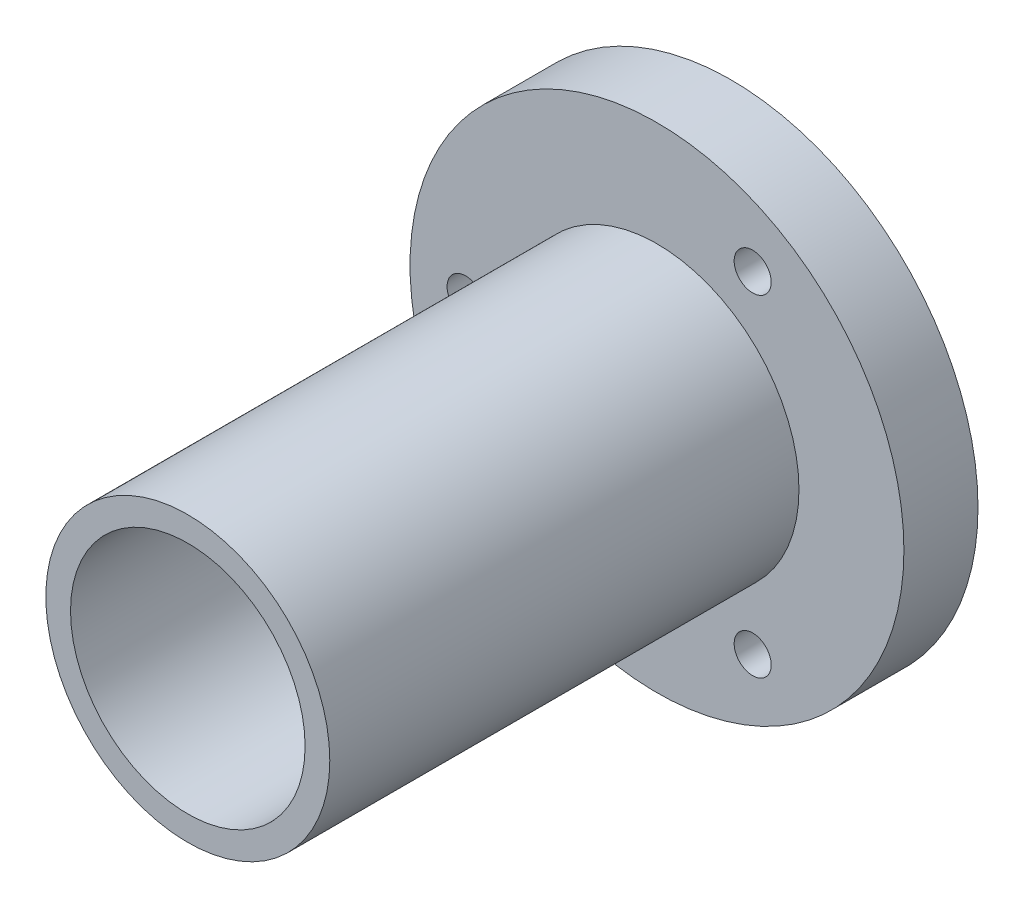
from build123d import *

# Parameters (mm, degrees)
ESQUISSE1_R                       = 20
BOSS_EXTRU_1_DEPTH                = 6
ESQUISSE2_R                       = 11.5
BOSS_EXTRU_2_DEPTH                = 38
DIAM_TRE_DU_PER_AGE_0_15_0_15_1_D = 19
DIAM_TRE_DU_PER_AGE_0_15_0_15_2_D = 3
R_P_TITION_CIRCULAIRE1_COUNT      = 3


with BuildPart() as part:
    # Esquisse1 → Boss.-Extru.1 (new body)
    with BuildSketch(Plane.XY):
        Circle(ESQUISSE1_R)
    extrude(amount=BOSS_EXTRU_1_DEPTH)

    # Esquisse2 → Boss.-Extru.2 (add)
    with BuildSketch(Plane.XY.offset(6)):
        Circle(ESQUISSE2_R)
    extrude(amount=BOSS_EXTRU_2_DEPTH)

    # Diam_tre du per_age _0.15 _0.15_1 (through all)
    with Locations(Plane(origin=(0, 0, 0), x_dir=(-1, 0, 0), z_dir=(0, 0, -1))):
        with Locations((0, 0)):
            Hole(DIAM_TRE_DU_PER_AGE_0_15_0_15_1_D / 2)

    # Diam_tre du per_age _0.15 _0.15_2 (through all)
    with Locations(Plane(origin=(0, 0, 0), x_dir=(-1, 0, 0), z_dir=(0, 0, -1))):
        with Locations((15.5, 0)):
            diam_tre_du_per_age_0_15_0_15_2 = Hole(DIAM_TRE_DU_PER_AGE_0_15_0_15_2_D / 2)

    # R_p_tition circulaire1: Diam_tre du per_age _0.15 _0.15_2 ×3 about axis
    r_p_tition_circulaire1_axis = Axis((0, 0, 0), (0, 0, 1))
    for i in range(1, R_P_TITION_CIRCULAIRE1_COUNT):
        add(diam_tre_du_per_age_0_15_0_15_2.rotate(r_p_tition_circulaire1_axis, i * 360 / R_P_TITION_CIRCULAIRE1_COUNT), mode=Mode.SUBTRACT)


solid = part.part
